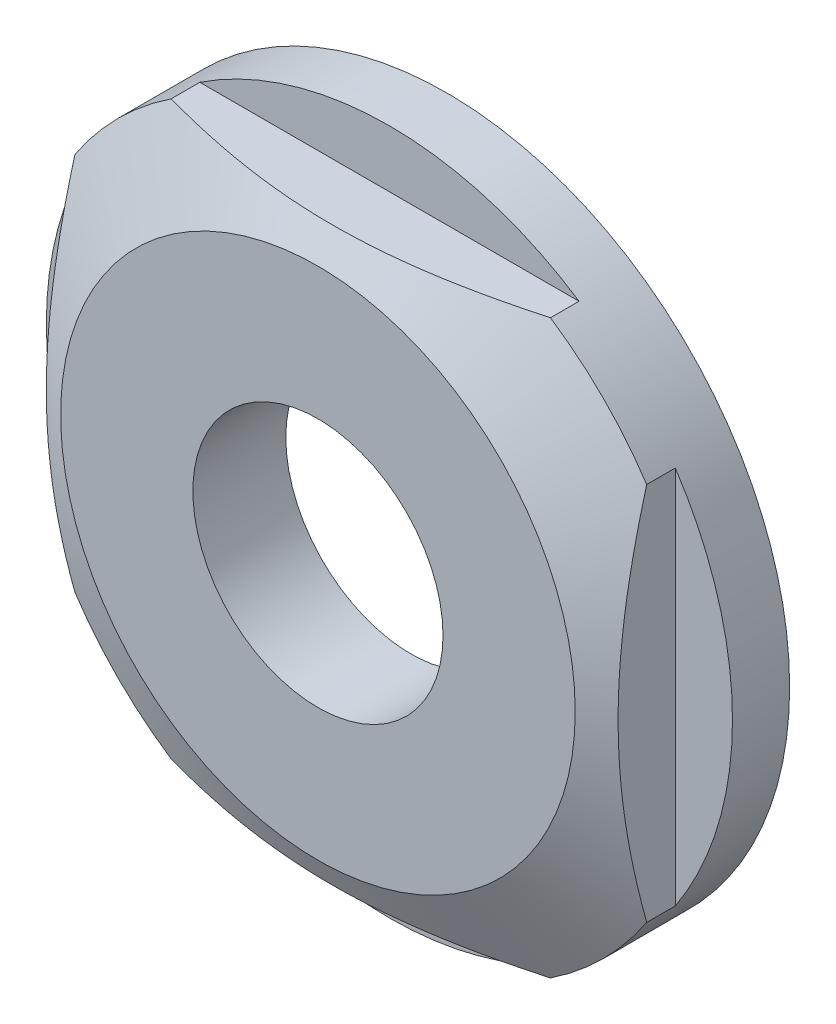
from build123d import *

# Parameters (mm, degrees)
ESQUISSE1_R                       = 24
BASE_EXTRUSION_DEPTH              = 9
CHANFREIN2_SIZE                   = 3
CHANFREIN2_SIZE2                  = 6
ESQUISSE2_W                       = 32.626427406
ESQUISSE2_H                       = 5.187601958
ESQUISSE2_W_2                     = 7.101685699
ESQUISSE2_H_2                     = 32.365415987
ESQUISSE2_W_3                     = 35.584556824
ESQUISSE2_H_3                     = 4.814715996
ESQUISSE2_W_4                     = 7.536704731
ESQUISSE2_H_4                     = 34.97553018
ENL_V_MAT_EXTRU_1_DEPTH           = 5
DIAM_TRE_DU_PER_AGE_17_5_17_5_1_D = 17.5
ESQUISSE5_R                       = 17.5
ESQUISSE5_R_2                     = 4.022283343
ENL_V_MAT_EXTRU_2_DEPTH           = 2.5


with BuildPart() as part:
    # Esquisse1 → Base-Extrusion (new body)
    with BuildSketch(Plane.XY):
        Circle(ESQUISSE1_R)
    extrude(amount=-BASE_EXTRUSION_DEPTH)

    # Chanfrein2
    chanfrein2_edges = [part.edges().sort_by_distance(p)[0] for p in [
        (-24, 0, 0),
    ]]
    chanfrein2_side = [part.faces().sort_by_distance(p)[0] for p in [
        (-24, 0, -4.5),
    ]]
    chamfer(chanfrein2_edges, length=CHANFREIN2_SIZE, length2=CHANFREIN2_SIZE2, reference=chanfrein2_side[0])

    # Esquisse2 → Enl_v. mat.-Extru.1 (cut)
    with BuildSketch(Plane.XY):
        with Locations((-0.174007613, 22.593800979)):
            Rectangle(ESQUISSE2_W, ESQUISSE2_H)
        with Locations((-23.55084285, 1.348559)):
            Rectangle(ESQUISSE2_W_2, ESQUISSE2_H_2)
        with Locations((0.174007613, -22.407357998)):
            Rectangle(ESQUISSE2_W_3, ESQUISSE2_H_3)
        with Locations((23.768352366, 0.652528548)):
            Rectangle(ESQUISSE2_W_4, ESQUISSE2_H_4)
    extrude(amount=-ENL_V_MAT_EXTRU_1_DEPTH, mode=Mode.SUBTRACT)

    # Diam_tre du per_age _17.5 _17.5_1 (through all)
    with Locations(Plane.XY):
        with Locations((0, 0)):
            Hole(DIAM_TRE_DU_PER_AGE_17_5_17_5_1_D / 2)

    # Esquisse5 → Enl_v. mat.-Extru.2 (cut)
    with BuildSketch(Plane(origin=(0, 0, -9), x_dir=(-1, 0, 0), z_dir=(0, 0, -1))):
        Circle(ESQUISSE5_R)
        Circle(ESQUISSE5_R_2, mode=Mode.SUBTRACT)
    extrude(amount=-ENL_V_MAT_EXTRU_2_DEPTH, mode=Mode.SUBTRACT)


solid = part.part
